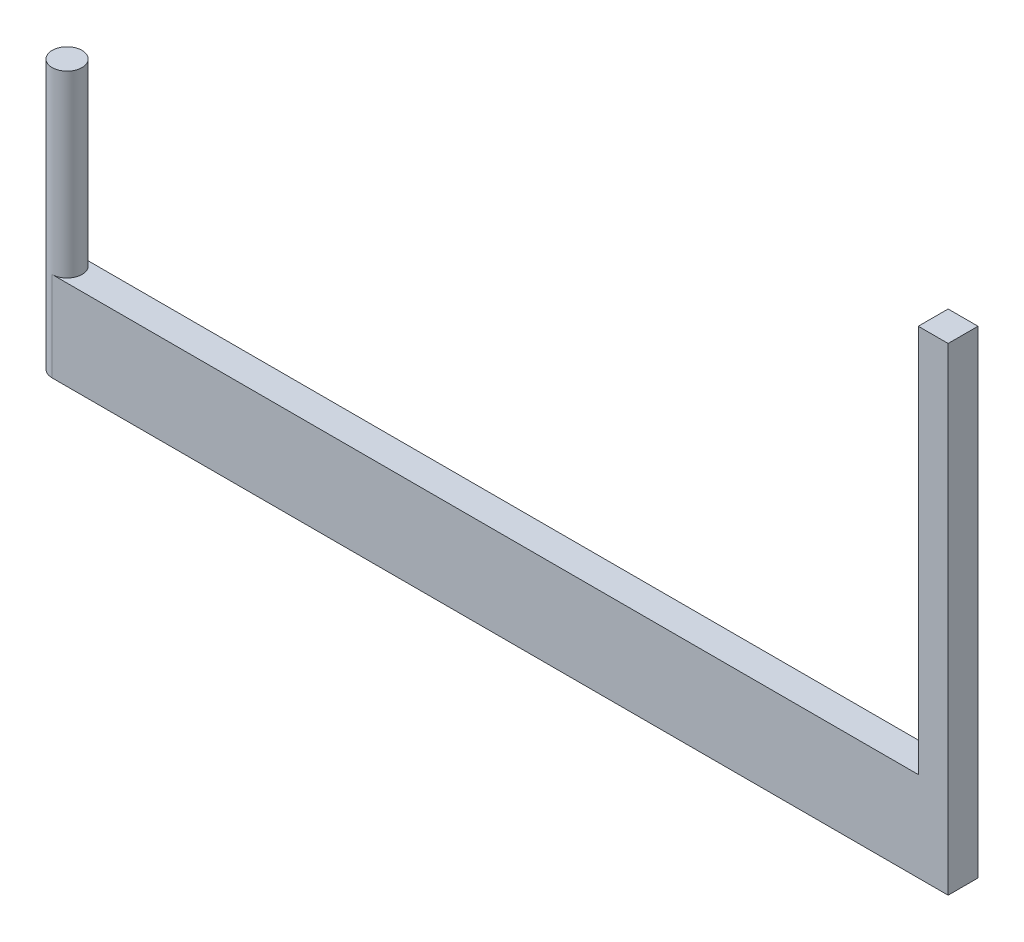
ISO-10303-21;
HEADER;
FILE_DESCRIPTION(('STEP AP214'),'2;1');
FILE_NAME('part.step','',(''),(''),'','','');
FILE_SCHEMA(('AUTOMOTIVE_DESIGN { 1 0 10303 214 1 1 1 1 }'));
ENDSEC;
DATA;
#1=APPLICATION_CONTEXT('core data for automotive mechanical design processes');
#2=APPLICATION_PROTOCOL_DEFINITION('international standard','automotive_design',2000,#1);
#3=PRODUCT_CONTEXT('',#1,'mechanical');
#4=PRODUCT('Part','Part','',(#3));
#5=PRODUCT_RELATED_PRODUCT_CATEGORY('part','',(#4));
#6=PRODUCT_DEFINITION_FORMATION('','',#4);
#7=PRODUCT_DEFINITION_CONTEXT('part definition',#1,'design');
#8=PRODUCT_DEFINITION('design','',#6,#7);
#9=PRODUCT_DEFINITION_SHAPE('','',#8);
#10=(LENGTH_UNIT() NAMED_UNIT(*) SI_UNIT(.MILLI.,.METRE.));
#11=(NAMED_UNIT(*) PLANE_ANGLE_UNIT() SI_UNIT($,.RADIAN.));
#12=(NAMED_UNIT(*) SI_UNIT($,.STERADIAN.) SOLID_ANGLE_UNIT());
#13=UNCERTAINTY_MEASURE_WITH_UNIT(LENGTH_MEASURE(1.E-05),#10,'distance_accuracy_value','');
#14=(GEOMETRIC_REPRESENTATION_CONTEXT(3) GLOBAL_UNCERTAINTY_ASSIGNED_CONTEXT((#13)) GLOBAL_UNIT_ASSIGNED_CONTEXT((#10,
#11,#12)) REPRESENTATION_CONTEXT('',''));
#15=CARTESIAN_POINT('',(0.,0.,0.));
#16=DIRECTION('',(0.,0.,1.));
#17=DIRECTION('',(1.,0.,0.));
#18=AXIS2_PLACEMENT_3D('',#15,#16,#17);
#19=CARTESIAN_POINT('',(0.,45.,0.));
#20=DIRECTION('',(0.,-1.,0.));
#21=DIRECTION('',(0.,0.,-1.));
#22=AXIS2_PLACEMENT_3D('',#19,#20,#21);
#23=CYLINDRICAL_SURFACE('',#22,2.5);
#24=CARTESIAN_POINT('',(0.,45.,0.));
#25=DIRECTION('',(0.,1.,0.));
#26=DIRECTION('',(0.,0.,1.));
#27=AXIS2_PLACEMENT_3D('',#24,#25,#26);
#28=CIRCLE('',#27,2.5);
#29=CARTESIAN_POINT('',(0.,45.,2.5));
#30=VERTEX_POINT('',#29);
#31=EDGE_CURVE('E11',#30,#30,#28,.T.);
#32=ORIENTED_EDGE('',*,*,#31,.F.);
#33=EDGE_LOOP('',(#32));
#34=FACE_BOUND('',#33,.T.);
#35=DIRECTION('',(0.,-1.,0.));
#36=VECTOR('',#35,1.);
#37=CARTESIAN_POINT('',(0.,15.,2.5));
#38=LINE('',#37,#36);
#39=CARTESIAN_POINT('',(0.,15.,2.5));
#40=VERTEX_POINT('',#39);
#41=CARTESIAN_POINT('',(0.,0.,2.5));
#42=VERTEX_POINT('',#41);
#43=EDGE_CURVE('E167',#40,#42,#38,.T.);
#44=ORIENTED_EDGE('',*,*,#43,.F.);
#45=CARTESIAN_POINT('',(0.,15.,0.));
#46=DIRECTION('',(0.,1.,0.));
#47=DIRECTION('',(0.,0.,1.));
#48=AXIS2_PLACEMENT_3D('',#45,#46,#47);
#49=CIRCLE('',#48,2.5);
#50=CARTESIAN_POINT('',(0.,15.,-2.5));
#51=VERTEX_POINT('',#50);
#52=EDGE_CURVE('E72',#40,#51,#49,.T.);
#53=ORIENTED_EDGE('',*,*,#52,.T.);
#54=DIRECTION('',(0.,-1.,0.));
#55=VECTOR('',#54,1.);
#56=CARTESIAN_POINT('',(0.,15.,-2.5));
#57=LINE('',#56,#55);
#58=CARTESIAN_POINT('',(0.,0.,-2.5));
#59=VERTEX_POINT('',#58);
#60=EDGE_CURVE('E118',#51,#59,#57,.T.);
#61=ORIENTED_EDGE('',*,*,#60,.T.);
#62=CARTESIAN_POINT('',(0.,0.,0.));
#63=DIRECTION('',(0.,1.,0.));
#64=DIRECTION('',(0.,0.,1.));
#65=AXIS2_PLACEMENT_3D('',#62,#63,#64);
#66=CIRCLE('',#65,2.5);
#67=EDGE_CURVE('E52',#59,#42,#66,.T.);
#68=ORIENTED_EDGE('',*,*,#67,.T.);
#69=EDGE_LOOP('',(#44,#53,#61,#68));
#70=FACE_BOUND('',#69,.T.);
#71=ADVANCED_FACE('F49',(#34,#70),#23,.T.);
#72=CARTESIAN_POINT('',(0.,45.,0.));
#73=DIRECTION('',(0.,1.,0.));
#74=DIRECTION('',(0.,0.,1.));
#75=AXIS2_PLACEMENT_3D('',#72,#73,#74);
#76=PLANE('',#75);
#77=ORIENTED_EDGE('',*,*,#31,.T.);
#78=EDGE_LOOP('',(#77));
#79=FACE_BOUND('',#78,.T.);
#80=ADVANCED_FACE('F192',(#79),#76,.T.);
#81=CARTESIAN_POINT('',(0.,0.,0.));
#82=DIRECTION('',(0.,1.,0.));
#83=DIRECTION('',(0.,0.,1.));
#84=AXIS2_PLACEMENT_3D('',#81,#82,#83);
#85=PLANE('',#84);
#86=ORIENTED_EDGE('',*,*,#67,.F.);
#87=DIRECTION('',(1.,0.,0.));
#88=VECTOR('',#87,1.);
#89=CARTESIAN_POINT('',(0.,0.,-2.5));
#90=LINE('',#89,#88);
#91=CARTESIAN_POINT('',(150.,0.,-2.5));
#92=VERTEX_POINT('',#91);
#93=EDGE_CURVE('E150',#59,#92,#90,.T.);
#94=ORIENTED_EDGE('',*,*,#93,.T.);
#95=DIRECTION('',(0.,0.,1.));
#96=VECTOR('',#95,1.);
#97=CARTESIAN_POINT('',(150.,0.,0.));
#98=LINE('',#97,#96);
#99=CARTESIAN_POINT('',(150.,0.,2.5));
#100=VERTEX_POINT('',#99);
#101=EDGE_CURVE('E111',#92,#100,#98,.T.);
#102=ORIENTED_EDGE('',*,*,#101,.T.);
#103=DIRECTION('',(-1.,0.,0.));
#104=VECTOR('',#103,1.);
#105=CARTESIAN_POINT('',(0.,0.,2.5));
#106=LINE('',#105,#104);
#107=EDGE_CURVE('E144',#100,#42,#106,.T.);
#108=ORIENTED_EDGE('',*,*,#107,.T.);
#109=EDGE_LOOP('',(#86,#94,#102,#108));
#110=FACE_BOUND('',#109,.T.);
#111=ADVANCED_FACE('F173',(#110),#85,.F.);
#112=CARTESIAN_POINT('',(0.,15.,2.5));
#113=DIRECTION('',(0.,0.,1.));
#114=DIRECTION('',(1.,0.,0.));
#115=AXIS2_PLACEMENT_3D('',#112,#113,#114);
#116=PLANE('',#115);
#117=ORIENTED_EDGE('',*,*,#107,.F.);
#118=DIRECTION('',(0.,-1.,0.));
#119=VECTOR('',#118,1.);
#120=CARTESIAN_POINT('',(150.,15.,2.5));
#121=LINE('',#120,#119);
#122=CARTESIAN_POINT('',(150.,80.,2.5));
#123=VERTEX_POINT('',#122);
#124=EDGE_CURVE('E117',#123,#100,#121,.T.);
#125=ORIENTED_EDGE('',*,*,#124,.F.);
#126=DIRECTION('',(-1.,0.,0.));
#127=VECTOR('',#126,1.);
#128=CARTESIAN_POINT('',(150.,80.,2.5));
#129=LINE('',#128,#127);
#130=CARTESIAN_POINT('',(145.,80.,2.5));
#131=VERTEX_POINT('',#130);
#132=EDGE_CURVE('E125',#123,#131,#129,.T.);
#133=ORIENTED_EDGE('',*,*,#132,.T.);
#134=DIRECTION('',(0.,-1.,0.));
#135=VECTOR('',#134,1.);
#136=CARTESIAN_POINT('',(145.,80.,2.5));
#137=LINE('',#136,#135);
#138=CARTESIAN_POINT('',(145.,15.,2.5));
#139=VERTEX_POINT('',#138);
#140=EDGE_CURVE('E64',#131,#139,#137,.T.);
#141=ORIENTED_EDGE('',*,*,#140,.T.);
#142=DIRECTION('',(-1.,0.,0.));
#143=VECTOR('',#142,1.);
#144=CARTESIAN_POINT('',(0.,15.,2.5));
#145=LINE('',#144,#143);
#146=EDGE_CURVE('E149',#139,#40,#145,.T.);
#147=ORIENTED_EDGE('',*,*,#146,.T.);
#148=ORIENTED_EDGE('',*,*,#43,.T.);
#149=EDGE_LOOP('',(#117,#125,#133,#141,#147,#148));
#150=FACE_BOUND('',#149,.T.);
#151=ADVANCED_FACE('F174',(#150),#116,.T.);
#152=CARTESIAN_POINT('',(150.,15.,0.));
#153=DIRECTION('',(1.,0.,0.));
#154=DIRECTION('',(0.,0.,-1.));
#155=AXIS2_PLACEMENT_3D('',#152,#153,#154);
#156=PLANE('',#155);
#157=ORIENTED_EDGE('',*,*,#101,.F.);
#158=DIRECTION('',(0.,-1.,0.));
#159=VECTOR('',#158,1.);
#160=CARTESIAN_POINT('',(150.,15.,-2.5));
#161=LINE('',#160,#159);
#162=CARTESIAN_POINT('',(150.,80.,-2.5));
#163=VERTEX_POINT('',#162);
#164=EDGE_CURVE('E105',#163,#92,#161,.T.);
#165=ORIENTED_EDGE('',*,*,#164,.F.);
#166=DIRECTION('',(0.,0.,1.));
#167=VECTOR('',#166,1.);
#168=CARTESIAN_POINT('',(150.,80.,-2.5));
#169=LINE('',#168,#167);
#170=EDGE_CURVE('E108',#163,#123,#169,.T.);
#171=ORIENTED_EDGE('',*,*,#170,.T.);
#172=ORIENTED_EDGE('',*,*,#124,.T.);
#173=EDGE_LOOP('',(#157,#165,#171,#172));
#174=FACE_BOUND('',#173,.T.);
#175=ADVANCED_FACE('F107',(#174),#156,.T.);
#176=CARTESIAN_POINT('',(0.,15.,-2.5));
#177=DIRECTION('',(0.,0.,-1.));
#178=DIRECTION('',(-1.,0.,0.));
#179=AXIS2_PLACEMENT_3D('',#176,#177,#178);
#180=PLANE('',#179);
#181=ORIENTED_EDGE('',*,*,#93,.F.);
#182=ORIENTED_EDGE('',*,*,#60,.F.);
#183=DIRECTION('',(1.,0.,0.));
#184=VECTOR('',#183,1.);
#185=CARTESIAN_POINT('',(0.,15.,-2.5));
#186=LINE('',#185,#184);
#187=CARTESIAN_POINT('',(145.,15.,-2.5));
#188=VERTEX_POINT('',#187);
#189=EDGE_CURVE('E153',#51,#188,#186,.T.);
#190=ORIENTED_EDGE('',*,*,#189,.T.);
#191=DIRECTION('',(0.,-1.,0.));
#192=VECTOR('',#191,1.);
#193=CARTESIAN_POINT('',(145.,80.,-2.5));
#194=LINE('',#193,#192);
#195=CARTESIAN_POINT('',(145.,80.,-2.5));
#196=VERTEX_POINT('',#195);
#197=EDGE_CURVE('E128',#196,#188,#194,.T.);
#198=ORIENTED_EDGE('',*,*,#197,.F.);
#199=DIRECTION('',(-1.,0.,0.));
#200=VECTOR('',#199,1.);
#201=CARTESIAN_POINT('',(150.,80.,-2.5));
#202=LINE('',#201,#200);
#203=EDGE_CURVE('E123',#163,#196,#202,.T.);
#204=ORIENTED_EDGE('',*,*,#203,.F.);
#205=ORIENTED_EDGE('',*,*,#164,.T.);
#206=EDGE_LOOP('',(#181,#182,#190,#198,#204,#205));
#207=FACE_BOUND('',#206,.T.);
#208=ADVANCED_FACE('F130',(#207),#180,.T.);
#209=CARTESIAN_POINT('',(0.,15.,0.));
#210=DIRECTION('',(0.,1.,0.));
#211=DIRECTION('',(0.,0.,1.));
#212=AXIS2_PLACEMENT_3D('',#209,#210,#211);
#213=PLANE('',#212);
#214=DIRECTION('',(0.,0.,1.));
#215=VECTOR('',#214,1.);
#216=CARTESIAN_POINT('',(145.,15.,-2.5));
#217=LINE('',#216,#215);
#218=EDGE_CURVE('E141',#188,#139,#217,.T.);
#219=ORIENTED_EDGE('',*,*,#218,.F.);
#220=ORIENTED_EDGE('',*,*,#189,.F.);
#221=ORIENTED_EDGE('',*,*,#52,.F.);
#222=ORIENTED_EDGE('',*,*,#146,.F.);
#223=EDGE_LOOP('',(#219,#220,#221,#222));
#224=FACE_BOUND('',#223,.T.);
#225=ADVANCED_FACE('F181',(#224),#213,.T.);
#226=CARTESIAN_POINT('',(145.,80.,-2.5));
#227=DIRECTION('',(-1.,0.,0.));
#228=DIRECTION('',(0.,0.,1.));
#229=AXIS2_PLACEMENT_3D('',#226,#227,#228);
#230=PLANE('',#229);
#231=ORIENTED_EDGE('',*,*,#140,.F.);
#232=DIRECTION('',(0.,0.,1.));
#233=VECTOR('',#232,1.);
#234=CARTESIAN_POINT('',(145.,80.,-2.5));
#235=LINE('',#234,#233);
#236=EDGE_CURVE('E127',#196,#131,#235,.T.);
#237=ORIENTED_EDGE('',*,*,#236,.F.);
#238=ORIENTED_EDGE('',*,*,#197,.T.);
#239=ORIENTED_EDGE('',*,*,#218,.T.);
#240=EDGE_LOOP('',(#231,#237,#238,#239));
#241=FACE_BOUND('',#240,.T.);
#242=ADVANCED_FACE('F176',(#241),#230,.T.);
#243=CARTESIAN_POINT('',(150.,80.,-2.5));
#244=DIRECTION('',(0.,1.,0.));
#245=DIRECTION('',(0.,0.,1.));
#246=AXIS2_PLACEMENT_3D('',#243,#244,#245);
#247=PLANE('',#246);
#248=ORIENTED_EDGE('',*,*,#132,.F.);
#249=ORIENTED_EDGE('',*,*,#170,.F.);
#250=ORIENTED_EDGE('',*,*,#203,.T.);
#251=ORIENTED_EDGE('',*,*,#236,.T.);
#252=EDGE_LOOP('',(#248,#249,#250,#251));
#253=FACE_BOUND('',#252,.T.);
#254=ADVANCED_FACE('F122',(#253),#247,.T.);
#255=CLOSED_SHELL('',(#71,#80,#111,#151,#175,#208,#225,#242,#254));
#256=MANIFOLD_SOLID_BREP('B2',#255);
#257=ADVANCED_BREP_SHAPE_REPRESENTATION('',(#18,#256),#14);
#258=SHAPE_DEFINITION_REPRESENTATION(#9,#257);
ENDSEC;
END-ISO-10303-21;
